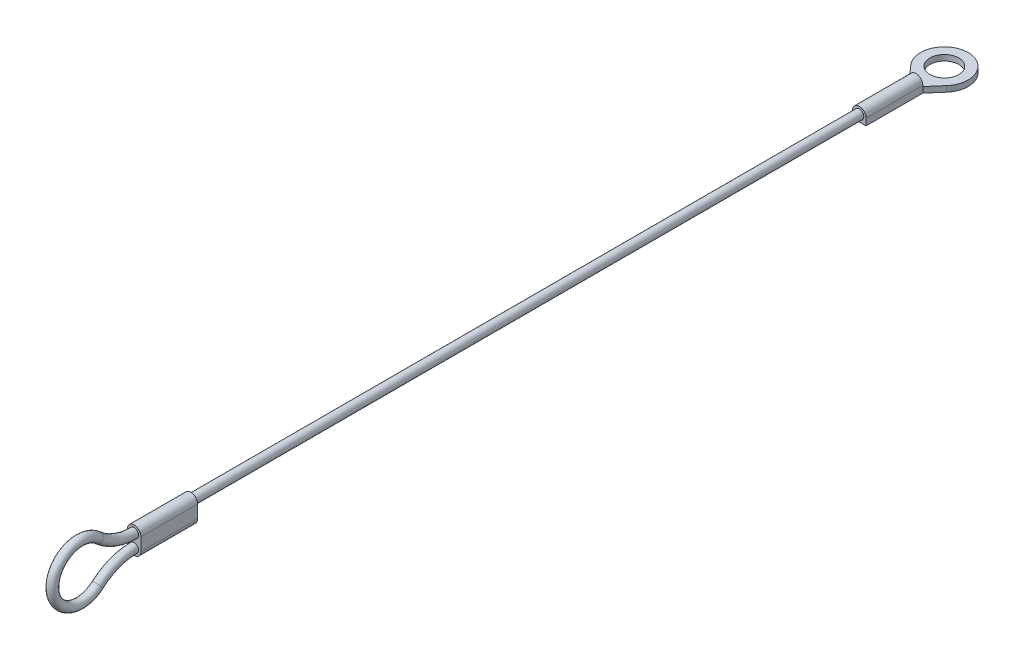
from build123d import *

# Parameters (mm, degrees)
SKETCH2_R           = 0.795
BOSS_EXTRUDE1_DEPTH = 10
BOSS_EXTRUDE2_DEPTH = 10
SKETCH5_R           = 2.54
BOSS_EXTRUDE3_DEPTH = 1.01


with BuildPart() as part:
    # Sweep1: sweep along a path in Sketch1
    with BuildLine(Plane(origin=(0, 0, 0), x_dir=(0, 0, -1), z_dir=(1, 0, 0))) as sweep1_path:
        Line((0, 0), (-127.8, 0))
        ThreePointArc((-127.8, 0), (-131.225492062, 0.631945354), (-134.2, 2.444582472))
        ThreePointArc((-134.2, 2.444582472), (-142.2, -1.133126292), (-134.2, -4.710835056))
        ThreePointArc((-134.2, -4.710835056), (-131.225492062, -2.898197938), (-127.8, -2.266252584))
    # Sketch2 → Sweep1 (sweep)
    with BuildSketch(Plane.XY):
        Circle(SKETCH2_R)
    sweep(path=sweep1_path.line)

    # Sketch3 → Boss-Extrude1 (add)
    with BuildSketch(Plane(origin=(0, 0, 127.8), x_dir=(-1, 0, 0), z_dir=(0, 0, -1))):
        with BuildLine():
            Line((1.2, 0), (1.2, -2.266252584))
            ThreePointArc((1.2, -2.266252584), (0, -3.466252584), (-1.2, -2.266252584))
            Line((-1.2, -2.266252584), (-1.2, 0))
            ThreePointArc((-1.2, 0), (0, 1.2), (1.2, 0))
        make_face()
    extrude(amount=BOSS_EXTRUDE1_DEPTH)

    # Sketch4 → Boss-Extrude2 (add)
    with BuildSketch(Plane(origin=(0, 0, 0), x_dir=(-1, 0, 0), z_dir=(0, 0, -1))):
        with BuildLine():
            Line((-1.2, 0), (-1.2, -1.2))
            Line((-1.2, -1.2), (0, -1.2))
            Line((0, -1.2), (1.2, -1.2))
            Line((1.2, -1.2), (1.2, 0))
            ThreePointArc((1.2, 0), (0, 1.2), (-1.2, 0))
        make_face()
    extrude(amount=BOSS_EXTRUDE2_DEPTH)

    # Sketch5 → Boss-Extrude3 (add)
    with BuildSketch(Plane.XZ.offset(1.2)):
        with BuildLine():
            Line((-1.2, -10), (1.2, -10))
            Line((1.2, -10), (3.158495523, -12.246818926))
            ThreePointArc((3.158495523, -12.246818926), (0, -19.19), (-3.158495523, -12.246818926))
            Line((-3.158495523, -12.246818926), (-1.2, -10))
        make_face()
        with Locations(Location((0, -15, 0), (0, 0, 270))):
            Circle(SKETCH5_R, mode=Mode.SUBTRACT)
    extrude(amount=-BOSS_EXTRUDE3_DEPTH)


solid = part.part
